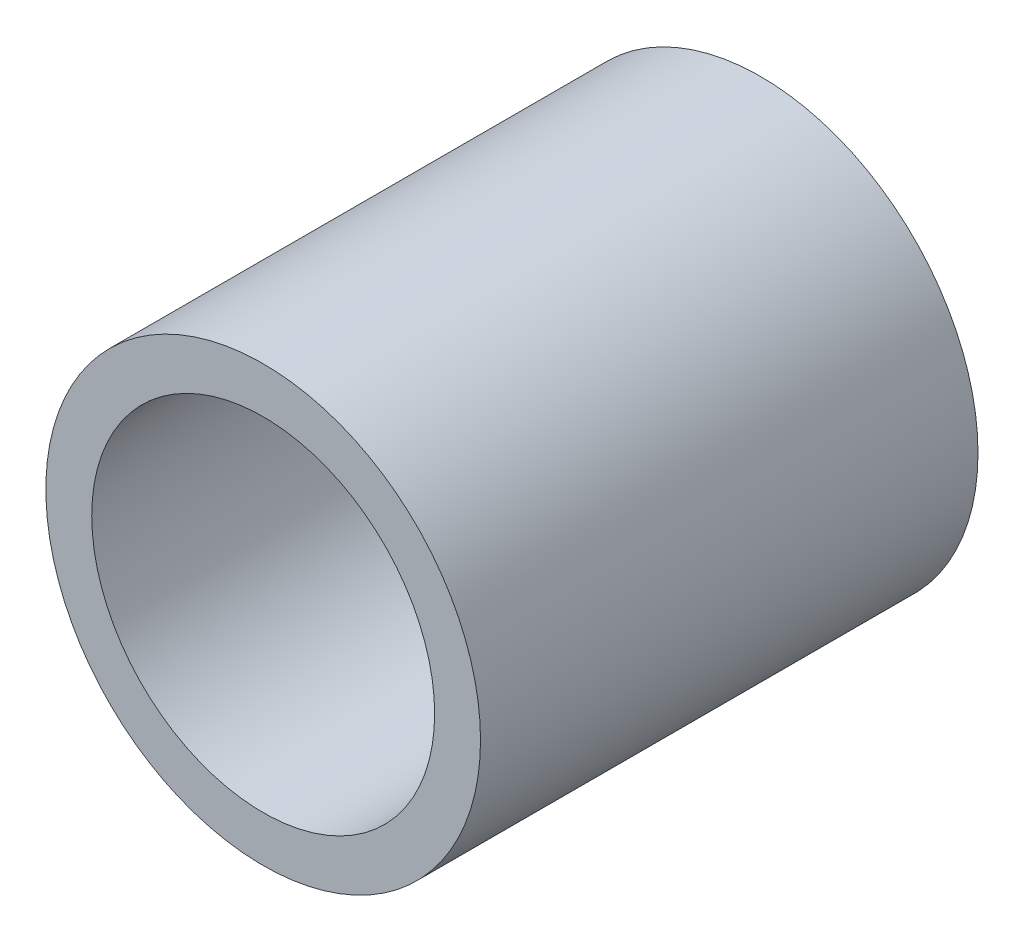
ISO-10303-21;
HEADER;
FILE_DESCRIPTION(('STEP AP214'),'2;1');
FILE_NAME('part.step','',(''),(''),'','','');
FILE_SCHEMA(('AUTOMOTIVE_DESIGN { 1 0 10303 214 1 1 1 1 }'));
ENDSEC;
DATA;
#1=APPLICATION_CONTEXT('core data for automotive mechanical design processes');
#2=APPLICATION_PROTOCOL_DEFINITION('international standard','automotive_design',2000,#1);
#3=PRODUCT_CONTEXT('',#1,'mechanical');
#4=PRODUCT('Part','Part','',(#3));
#5=PRODUCT_RELATED_PRODUCT_CATEGORY('part','',(#4));
#6=PRODUCT_DEFINITION_FORMATION('','',#4);
#7=PRODUCT_DEFINITION_CONTEXT('part definition',#1,'design');
#8=PRODUCT_DEFINITION('design','',#6,#7);
#9=PRODUCT_DEFINITION_SHAPE('','',#8);
#10=(LENGTH_UNIT() NAMED_UNIT(*) SI_UNIT(.MILLI.,.METRE.));
#11=(NAMED_UNIT(*) PLANE_ANGLE_UNIT() SI_UNIT($,.RADIAN.));
#12=(NAMED_UNIT(*) SI_UNIT($,.STERADIAN.) SOLID_ANGLE_UNIT());
#13=UNCERTAINTY_MEASURE_WITH_UNIT(LENGTH_MEASURE(1.E-05),#10,'distance_accuracy_value','');
#14=(GEOMETRIC_REPRESENTATION_CONTEXT(3) GLOBAL_UNCERTAINTY_ASSIGNED_CONTEXT((#13)) GLOBAL_UNIT_ASSIGNED_CONTEXT((#10,
#11,#12)) REPRESENTATION_CONTEXT('',''));
#15=CARTESIAN_POINT('',(0.,0.,0.));
#16=DIRECTION('',(0.,0.,1.));
#17=DIRECTION('',(1.,0.,0.));
#18=AXIS2_PLACEMENT_3D('',#15,#16,#17);
#19=CARTESIAN_POINT('',(0.,0.,51.5));
#20=DIRECTION('',(0.,0.,-1.));
#21=DIRECTION('',(-1.,0.,0.));
#22=AXIS2_PLACEMENT_3D('',#19,#20,#21);
#23=CYLINDRICAL_SURFACE('',#22,22.5);
#24=CARTESIAN_POINT('',(0.,0.,51.5));
#25=DIRECTION('',(0.,0.,1.));
#26=DIRECTION('',(1.,0.,0.));
#27=AXIS2_PLACEMENT_3D('',#24,#25,#26);
#28=CIRCLE('',#27,22.5);
#29=CARTESIAN_POINT('',(22.5,0.,51.5));
#30=VERTEX_POINT('',#29);
#31=EDGE_CURVE('E10',#30,#30,#28,.T.);
#32=ORIENTED_EDGE('',*,*,#31,.F.);
#33=EDGE_LOOP('',(#32));
#34=FACE_BOUND('',#33,.T.);
#35=CARTESIAN_POINT('',(0.,0.,0.));
#36=DIRECTION('',(0.,0.,1.));
#37=DIRECTION('',(1.,0.,0.));
#38=AXIS2_PLACEMENT_3D('',#35,#36,#37);
#39=CIRCLE('',#38,22.5);
#40=CARTESIAN_POINT('',(22.5,0.,0.));
#41=VERTEX_POINT('',#40);
#42=EDGE_CURVE('E40',#41,#41,#39,.T.);
#43=ORIENTED_EDGE('',*,*,#42,.T.);
#44=EDGE_LOOP('',(#43));
#45=FACE_BOUND('',#44,.T.);
#46=ADVANCED_FACE('F37',(#34,#45),#23,.T.);
#47=CARTESIAN_POINT('',(0.,0.,51.5));
#48=DIRECTION('',(0.,0.,1.));
#49=DIRECTION('',(1.,0.,0.));
#50=AXIS2_PLACEMENT_3D('',#47,#48,#49);
#51=PLANE('',#50);
#52=CARTESIAN_POINT('',(0.,0.,51.5));
#53=DIRECTION('',(0.,0.,1.));
#54=DIRECTION('',(1.,0.,0.));
#55=AXIS2_PLACEMENT_3D('',#52,#53,#54);
#56=CIRCLE('',#55,17.75);
#57=CARTESIAN_POINT('',(17.75,0.,51.5));
#58=VERTEX_POINT('',#57);
#59=EDGE_CURVE('E51',#58,#58,#56,.T.);
#60=ORIENTED_EDGE('',*,*,#59,.F.);
#61=EDGE_LOOP('',(#60));
#62=FACE_BOUND('',#61,.T.);
#63=ORIENTED_EDGE('',*,*,#31,.T.);
#64=EDGE_LOOP('',(#63));
#65=FACE_BOUND('',#64,.T.);
#66=ADVANCED_FACE('F68',(#62,#65),#51,.T.);
#67=CARTESIAN_POINT('',(0.,0.,0.));
#68=DIRECTION('',(0.,0.,1.));
#69=DIRECTION('',(1.,0.,0.));
#70=AXIS2_PLACEMENT_3D('',#67,#68,#69);
#71=PLANE('',#70);
#72=CARTESIAN_POINT('',(0.,0.,0.));
#73=DIRECTION('',(0.,0.,1.));
#74=DIRECTION('',(1.,0.,0.));
#75=AXIS2_PLACEMENT_3D('',#72,#73,#74);
#76=CIRCLE('',#75,17.75);
#77=CARTESIAN_POINT('',(17.75,0.,0.));
#78=VERTEX_POINT('',#77);
#79=EDGE_CURVE('E49',#78,#78,#76,.T.);
#80=ORIENTED_EDGE('',*,*,#79,.T.);
#81=EDGE_LOOP('',(#80));
#82=FACE_BOUND('',#81,.T.);
#83=ORIENTED_EDGE('',*,*,#42,.F.);
#84=EDGE_LOOP('',(#83));
#85=FACE_BOUND('',#84,.T.);
#86=ADVANCED_FACE('F59',(#82,#85),#71,.F.);
#87=CARTESIAN_POINT('',(0.,0.,0.));
#88=DIRECTION('',(0.,0.,1.));
#89=DIRECTION('',(1.,0.,0.));
#90=AXIS2_PLACEMENT_3D('',#87,#88,#89);
#91=CYLINDRICAL_SURFACE('',#90,17.75);
#92=ORIENTED_EDGE('',*,*,#79,.F.);
#93=EDGE_LOOP('',(#92));
#94=FACE_BOUND('',#93,.T.);
#95=ORIENTED_EDGE('',*,*,#59,.T.);
#96=EDGE_LOOP('',(#95));
#97=FACE_BOUND('',#96,.T.);
#98=ADVANCED_FACE('F62',(#94,#97),#91,.F.);
#99=CLOSED_SHELL('',(#46,#66,#86,#98));
#100=MANIFOLD_SOLID_BREP('B2',#99);
#101=ADVANCED_BREP_SHAPE_REPRESENTATION('',(#18,#100),#14);
#102=SHAPE_DEFINITION_REPRESENTATION(#9,#101);
ENDSEC;
END-ISO-10303-21;
